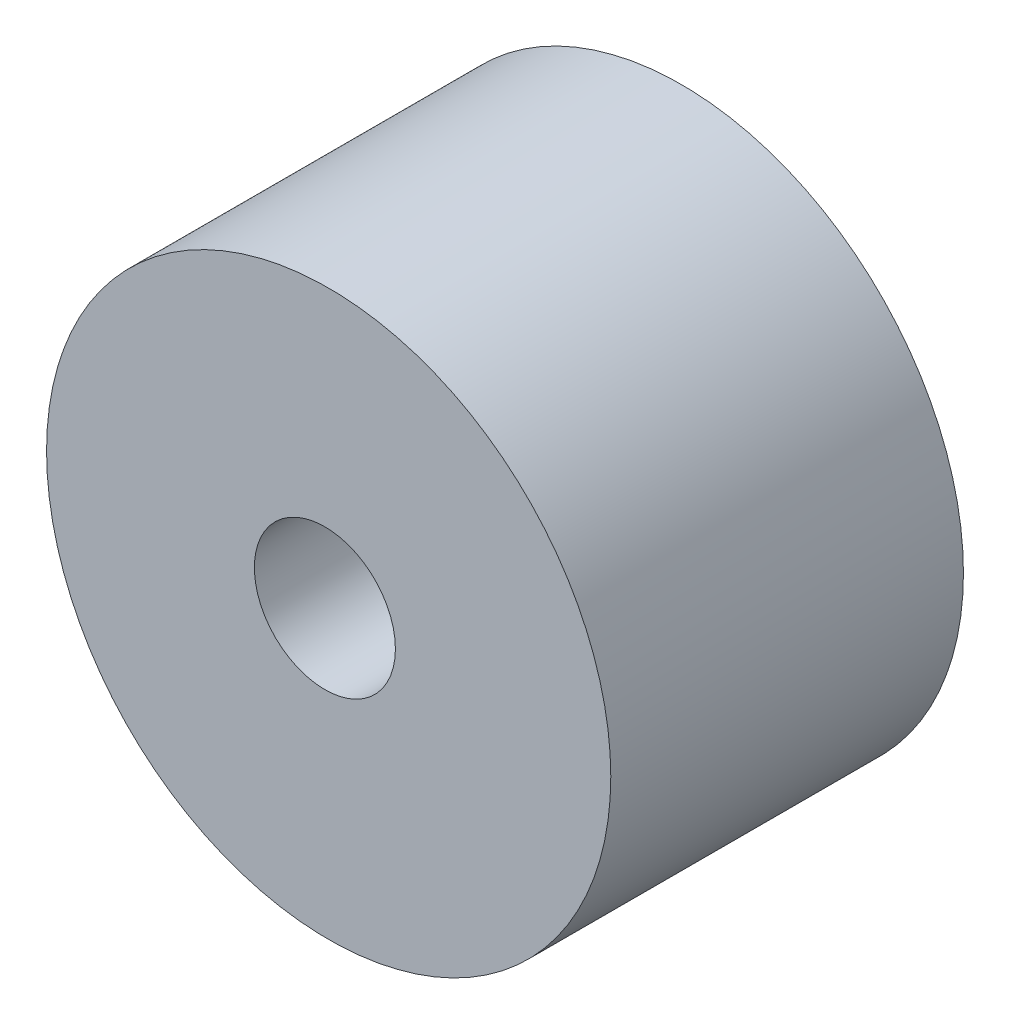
from build123d import *

# Parameters (mm, degrees)
SKETCH3_R           = 40
BOSS_EXTRUDE1_DEPTH = 50
SKETCH4_R           = 10
CUT_EXTRUDE1_DEPTH  = 76.831347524


with BuildPart() as part:
    # Sketch3 → Boss-Extrude1 (new body)
    with BuildSketch(Plane.XY):
        with Locations((0.35851737, -0.268888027)):
            Circle(SKETCH3_R)
    extrude(amount=BOSS_EXTRUDE1_DEPTH)

    # Sketch4 → Cut-Extrude1 (cut, through all)
    with BuildSketch(Plane.XY.offset(50)):
        with Locations((-0.179480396, 0.150907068)):
            Circle(SKETCH4_R)
    extrude(amount=-CUT_EXTRUDE1_DEPTH, mode=Mode.SUBTRACT)


solid = part.part
